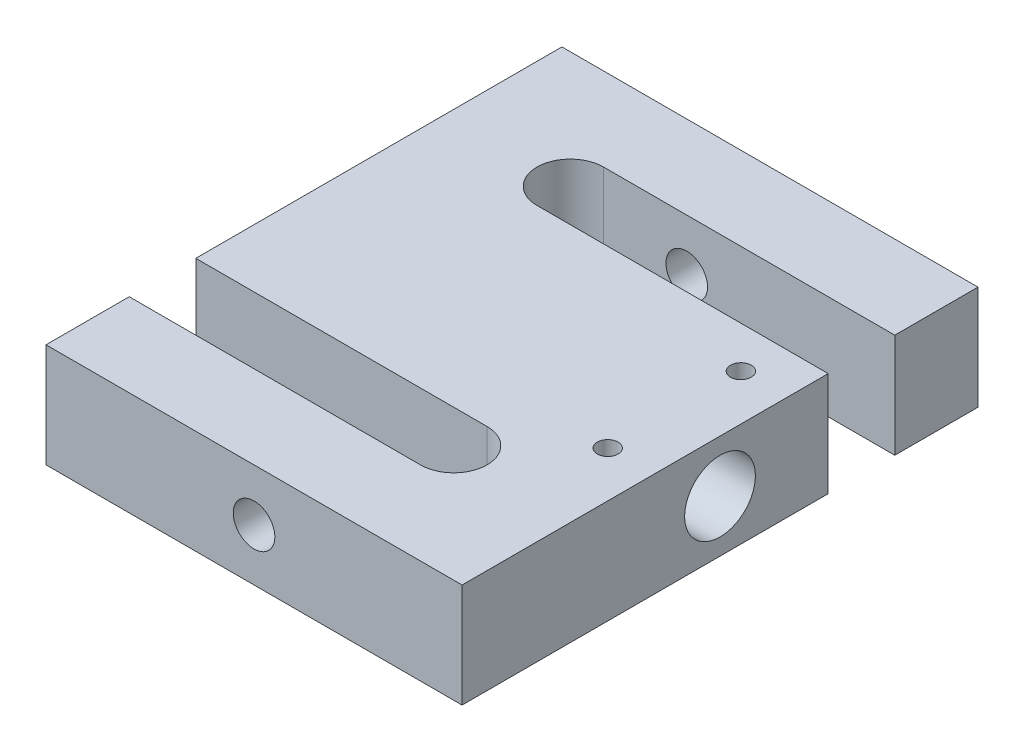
ISO-10303-21;
HEADER;
FILE_DESCRIPTION(('STEP AP214'),'2;1');
FILE_NAME('part.step','',(''),(''),'','','');
FILE_SCHEMA(('AUTOMOTIVE_DESIGN { 1 0 10303 214 1 1 1 1 }'));
ENDSEC;
DATA;
#1=APPLICATION_CONTEXT('core data for automotive mechanical design processes');
#2=APPLICATION_PROTOCOL_DEFINITION('international standard','automotive_design',2000,#1);
#3=PRODUCT_CONTEXT('',#1,'mechanical');
#4=PRODUCT('Part','Part','',(#3));
#5=PRODUCT_RELATED_PRODUCT_CATEGORY('part','',(#4));
#6=PRODUCT_DEFINITION_FORMATION('','',#4);
#7=PRODUCT_DEFINITION_CONTEXT('part definition',#1,'design');
#8=PRODUCT_DEFINITION('design','',#6,#7);
#9=PRODUCT_DEFINITION_SHAPE('','',#8);
#10=(LENGTH_UNIT() NAMED_UNIT(*) SI_UNIT(.MILLI.,.METRE.));
#11=(NAMED_UNIT(*) PLANE_ANGLE_UNIT() SI_UNIT($,.RADIAN.));
#12=(NAMED_UNIT(*) SI_UNIT($,.STERADIAN.) SOLID_ANGLE_UNIT());
#13=UNCERTAINTY_MEASURE_WITH_UNIT(LENGTH_MEASURE(1.E-05),#10,'distance_accuracy_value','');
#14=(GEOMETRIC_REPRESENTATION_CONTEXT(3) GLOBAL_UNCERTAINTY_ASSIGNED_CONTEXT((#13)) GLOBAL_UNIT_ASSIGNED_CONTEXT((#10,
#11,#12)) REPRESENTATION_CONTEXT('',''));
#15=CARTESIAN_POINT('',(0.,0.,0.));
#16=DIRECTION('',(0.,0.,1.));
#17=DIRECTION('',(1.,0.,0.));
#18=AXIS2_PLACEMENT_3D('',#15,#16,#17);
#19=CARTESIAN_POINT('',(0.,12.5,-62.));
#20=DIRECTION('',(0.,0.,1.));
#21=DIRECTION('',(1.,0.,0.));
#22=AXIS2_PLACEMENT_3D('',#19,#20,#21);
#23=PLANE('',#22);
#24=DIRECTION('',(-1.,0.,0.));
#25=VECTOR('',#24,1.);
#26=CARTESIAN_POINT('',(0.,0.,-62.));
#27=LINE('',#26,#25);
#28=CARTESIAN_POINT('',(50.,0.,-62.));
#29=VERTEX_POINT('',#28);
#30=CARTESIAN_POINT('',(0.,0.,-62.));
#31=VERTEX_POINT('',#30);
#32=EDGE_CURVE('E173',#29,#31,#27,.T.);
#33=ORIENTED_EDGE('',*,*,#32,.T.);
#34=DIRECTION('',(0.,-1.,0.));
#35=VECTOR('',#34,1.);
#36=CARTESIAN_POINT('',(0.,12.5,-62.));
#37=LINE('',#36,#35);
#38=CARTESIAN_POINT('',(0.,12.5,-62.));
#39=VERTEX_POINT('',#38);
#40=EDGE_CURVE('E184',#39,#31,#37,.T.);
#41=ORIENTED_EDGE('',*,*,#40,.F.);
#42=DIRECTION('',(-1.,0.,0.));
#43=VECTOR('',#42,1.);
#44=CARTESIAN_POINT('',(0.,12.5,-62.));
#45=LINE('',#44,#43);
#46=CARTESIAN_POINT('',(50.,12.5,-62.));
#47=VERTEX_POINT('',#46);
#48=EDGE_CURVE('E233',#47,#39,#45,.T.);
#49=ORIENTED_EDGE('',*,*,#48,.F.);
#50=DIRECTION('',(0.,-1.,0.));
#51=VECTOR('',#50,1.);
#52=CARTESIAN_POINT('',(50.,12.5,-62.));
#53=LINE('',#52,#51);
#54=EDGE_CURVE('E187',#47,#29,#53,.T.);
#55=ORIENTED_EDGE('',*,*,#54,.T.);
#56=EDGE_LOOP('',(#33,#41,#49,#55));
#57=FACE_BOUND('',#56,.T.);
#58=CARTESIAN_POINT('',(25.,6.25,-62.));
#59=DIRECTION('',(0.,0.,-1.));
#60=DIRECTION('',(-1.,0.,0.));
#61=AXIS2_PLACEMENT_3D('',#58,#59,#60);
#62=CIRCLE('',#61,2.49999999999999);
#63=CARTESIAN_POINT('',(22.5,6.25,-62.));
#64=VERTEX_POINT('',#63);
#65=EDGE_CURVE('E293',#64,#64,#62,.T.);
#66=ORIENTED_EDGE('',*,*,#65,.F.);
#67=EDGE_LOOP('',(#66));
#68=FACE_BOUND('',#67,.T.);
#69=ADVANCED_FACE('F34',(#57,#68),#23,.F.);
#70=CARTESIAN_POINT('',(0.,12.5,0.));
#71=DIRECTION('',(0.,0.,-1.));
#72=DIRECTION('',(-1.,0.,0.));
#73=AXIS2_PLACEMENT_3D('',#70,#71,#72);
#74=PLANE('',#73);
#75=DIRECTION('',(1.,0.,0.));
#76=VECTOR('',#75,1.);
#77=CARTESIAN_POINT('',(0.,0.,0.));
#78=LINE('',#77,#76);
#79=CARTESIAN_POINT('',(0.,0.,0.));
#80=VERTEX_POINT('',#79);
#81=CARTESIAN_POINT('',(50.,0.,0.));
#82=VERTEX_POINT('',#81);
#83=EDGE_CURVE('E160',#80,#82,#78,.T.);
#84=ORIENTED_EDGE('',*,*,#83,.T.);
#85=DIRECTION('',(0.,-1.,0.));
#86=VECTOR('',#85,1.);
#87=CARTESIAN_POINT('',(50.,12.5,0.));
#88=LINE('',#87,#86);
#89=CARTESIAN_POINT('',(50.,12.5,0.));
#90=VERTEX_POINT('',#89);
#91=EDGE_CURVE('E43',#90,#82,#88,.T.);
#92=ORIENTED_EDGE('',*,*,#91,.F.);
#93=DIRECTION('',(1.,0.,0.));
#94=VECTOR('',#93,1.);
#95=CARTESIAN_POINT('',(0.,12.5,0.));
#96=LINE('',#95,#94);
#97=CARTESIAN_POINT('',(0.,12.5,0.));
#98=VERTEX_POINT('',#97);
#99=EDGE_CURVE('E107',#98,#90,#96,.T.);
#100=ORIENTED_EDGE('',*,*,#99,.F.);
#101=DIRECTION('',(0.,-1.,0.));
#102=VECTOR('',#101,1.);
#103=CARTESIAN_POINT('',(0.,12.5,0.));
#104=LINE('',#103,#102);
#105=EDGE_CURVE('E11',#98,#80,#104,.T.);
#106=ORIENTED_EDGE('',*,*,#105,.T.);
#107=EDGE_LOOP('',(#84,#92,#100,#106));
#108=FACE_BOUND('',#107,.T.);
#109=CARTESIAN_POINT('',(25.,6.25,0.));
#110=DIRECTION('',(0.,0.,1.));
#111=DIRECTION('',(1.,0.,0.));
#112=AXIS2_PLACEMENT_3D('',#109,#110,#111);
#113=CIRCLE('',#112,2.5);
#114=CARTESIAN_POINT('',(27.5,6.25,0.));
#115=VERTEX_POINT('',#114);
#116=EDGE_CURVE('E301',#115,#115,#113,.T.);
#117=ORIENTED_EDGE('',*,*,#116,.F.);
#118=EDGE_LOOP('',(#117));
#119=FACE_BOUND('',#118,.T.);
#120=ADVANCED_FACE('F261',(#108,#119),#74,.F.);
#121=CARTESIAN_POINT('',(0.,12.5,0.));
#122=DIRECTION('',(1.,0.,0.));
#123=DIRECTION('',(0.,0.,-1.));
#124=AXIS2_PLACEMENT_3D('',#121,#122,#123);
#125=PLANE('',#124);
#126=DIRECTION('',(0.,0.,1.));
#127=VECTOR('',#126,1.);
#128=CARTESIAN_POINT('',(0.,0.,0.));
#129=LINE('',#128,#127);
#130=CARTESIAN_POINT('',(0.,0.,-9.99999999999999));
#131=VERTEX_POINT('',#130);
#132=EDGE_CURVE('E157',#131,#80,#129,.T.);
#133=ORIENTED_EDGE('',*,*,#132,.T.);
#134=ORIENTED_EDGE('',*,*,#105,.F.);
#135=DIRECTION('',(0.,0.,1.));
#136=VECTOR('',#135,1.);
#137=CARTESIAN_POINT('',(0.,12.5,0.));
#138=LINE('',#137,#136);
#139=CARTESIAN_POINT('',(0.,12.5,-9.99999999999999));
#140=VERTEX_POINT('',#139);
#141=EDGE_CURVE('E180',#140,#98,#138,.T.);
#142=ORIENTED_EDGE('',*,*,#141,.F.);
#143=DIRECTION('',(0.,-1.,0.));
#144=VECTOR('',#143,1.);
#145=CARTESIAN_POINT('',(0.,12.5,-9.99999999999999));
#146=LINE('',#145,#144);
#147=EDGE_CURVE('E153',#140,#131,#146,.T.);
#148=ORIENTED_EDGE('',*,*,#147,.T.);
#149=EDGE_LOOP('',(#133,#134,#142,#148));
#150=FACE_BOUND('',#149,.T.);
#151=ADVANCED_FACE('F36',(#150),#125,.F.);
#152=CARTESIAN_POINT('',(50.,12.5,0.));
#153=DIRECTION('',(-1.,0.,0.));
#154=DIRECTION('',(0.,0.,1.));
#155=AXIS2_PLACEMENT_3D('',#152,#153,#154);
#156=PLANE('',#155);
#157=CARTESIAN_POINT('',(50.,6.25,-31.));
#158=DIRECTION('',(1.,0.,0.));
#159=DIRECTION('',(0.,0.,-1.));
#160=AXIS2_PLACEMENT_3D('',#157,#158,#159);
#161=CIRCLE('',#160,4.25);
#162=CARTESIAN_POINT('',(50.,6.25,-35.25));
#163=VERTEX_POINT('',#162);
#164=EDGE_CURVE('E288',#163,#163,#161,.T.);
#165=ORIENTED_EDGE('',*,*,#164,.F.);
#166=EDGE_LOOP('',(#165));
#167=FACE_BOUND('',#166,.T.);
#168=DIRECTION('',(0.,0.,-1.));
#169=VECTOR('',#168,1.);
#170=CARTESIAN_POINT('',(50.,0.,0.));
#171=LINE('',#170,#169);
#172=CARTESIAN_POINT('',(50.,0.,-44.));
#173=VERTEX_POINT('',#172);
#174=EDGE_CURVE('E163',#82,#173,#171,.T.);
#175=ORIENTED_EDGE('',*,*,#174,.T.);
#176=DIRECTION('',(0.,-1.,0.));
#177=VECTOR('',#176,1.);
#178=CARTESIAN_POINT('',(50.,12.5,-44.));
#179=LINE('',#178,#177);
#180=CARTESIAN_POINT('',(50.,12.5,-44.));
#181=VERTEX_POINT('',#180);
#182=EDGE_CURVE('E199',#181,#173,#179,.T.);
#183=ORIENTED_EDGE('',*,*,#182,.F.);
#184=DIRECTION('',(0.,0.,-1.));
#185=VECTOR('',#184,1.);
#186=CARTESIAN_POINT('',(50.,12.5,0.));
#187=LINE('',#186,#185);
#188=EDGE_CURVE('E207',#90,#181,#187,.T.);
#189=ORIENTED_EDGE('',*,*,#188,.F.);
#190=ORIENTED_EDGE('',*,*,#91,.T.);
#191=EDGE_LOOP('',(#175,#183,#189,#190));
#192=FACE_BOUND('',#191,.T.);
#193=ADVANCED_FACE('F205',(#167,#192),#156,.F.);
#194=CARTESIAN_POINT('',(15.,12.5,-44.));
#195=DIRECTION('',(0.,0.,1.));
#196=DIRECTION('',(1.,0.,0.));
#197=AXIS2_PLACEMENT_3D('',#194,#195,#196);
#198=PLANE('',#197);
#199=DIRECTION('',(-1.,0.,0.));
#200=VECTOR('',#199,1.);
#201=CARTESIAN_POINT('',(15.,0.,-44.));
#202=LINE('',#201,#200);
#203=CARTESIAN_POINT('',(15.,0.,-44.));
#204=VERTEX_POINT('',#203);
#205=EDGE_CURVE('E165',#173,#204,#202,.T.);
#206=ORIENTED_EDGE('',*,*,#205,.T.);
#207=DIRECTION('',(0.,-1.,0.));
#208=VECTOR('',#207,1.);
#209=CARTESIAN_POINT('',(15.,12.5,-44.));
#210=LINE('',#209,#208);
#211=CARTESIAN_POINT('',(15.,12.5,-44.));
#212=VERTEX_POINT('',#211);
#213=EDGE_CURVE('E196',#212,#204,#210,.T.);
#214=ORIENTED_EDGE('',*,*,#213,.F.);
#215=DIRECTION('',(-1.,0.,0.));
#216=VECTOR('',#215,1.);
#217=CARTESIAN_POINT('',(15.,12.5,-44.));
#218=LINE('',#217,#216);
#219=EDGE_CURVE('E225',#181,#212,#218,.T.);
#220=ORIENTED_EDGE('',*,*,#219,.F.);
#221=ORIENTED_EDGE('',*,*,#182,.T.);
#222=EDGE_LOOP('',(#206,#214,#220,#221));
#223=FACE_BOUND('',#222,.T.);
#224=ADVANCED_FACE('F216',(#223),#198,.F.);
#225=CARTESIAN_POINT('',(15.,12.5,-48.));
#226=DIRECTION('',(0.,-1.,0.));
#227=DIRECTION('',(0.,0.,-1.));
#228=AXIS2_PLACEMENT_3D('',#225,#226,#227);
#229=CYLINDRICAL_SURFACE('',#228,4.);
#230=CARTESIAN_POINT('',(15.,0.,-48.));
#231=DIRECTION('',(0.,-1.,0.));
#232=DIRECTION('',(0.,0.,1.));
#233=AXIS2_PLACEMENT_3D('',#230,#231,#232);
#234=CIRCLE('',#233,4.);
#235=CARTESIAN_POINT('',(15.,0.,-52.));
#236=VERTEX_POINT('',#235);
#237=EDGE_CURVE('E167',#204,#236,#234,.T.);
#238=ORIENTED_EDGE('',*,*,#237,.T.);
#239=DIRECTION('',(0.,-1.,0.));
#240=VECTOR('',#239,1.);
#241=CARTESIAN_POINT('',(15.,12.5,-52.));
#242=LINE('',#241,#240);
#243=CARTESIAN_POINT('',(15.,12.5,-52.));
#244=VERTEX_POINT('',#243);
#245=EDGE_CURVE('E193',#244,#236,#242,.T.);
#246=ORIENTED_EDGE('',*,*,#245,.F.);
#247=CARTESIAN_POINT('',(15.,12.5,-48.));
#248=DIRECTION('',(0.,-1.,0.));
#249=DIRECTION('',(0.,0.,1.));
#250=AXIS2_PLACEMENT_3D('',#247,#248,#249);
#251=CIRCLE('',#250,4.);
#252=EDGE_CURVE('E222',#212,#244,#251,.T.);
#253=ORIENTED_EDGE('',*,*,#252,.F.);
#254=ORIENTED_EDGE('',*,*,#213,.T.);
#255=EDGE_LOOP('',(#238,#246,#253,#254));
#256=FACE_BOUND('',#255,.T.);
#257=ADVANCED_FACE('F220',(#256),#229,.F.);
#258=CARTESIAN_POINT('',(15.,12.5,-52.));
#259=DIRECTION('',(0.,0.,-1.));
#260=DIRECTION('',(-1.,0.,0.));
#261=AXIS2_PLACEMENT_3D('',#258,#259,#260);
#262=PLANE('',#261);
#263=CARTESIAN_POINT('',(25.,6.25,-52.));
#264=DIRECTION('',(0.,0.,-1.));
#265=DIRECTION('',(-1.,0.,0.));
#266=AXIS2_PLACEMENT_3D('',#263,#264,#265);
#267=CIRCLE('',#266,2.49999999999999);
#268=CARTESIAN_POINT('',(22.5,6.25,-52.));
#269=VERTEX_POINT('',#268);
#270=EDGE_CURVE('E298',#269,#269,#267,.T.);
#271=ORIENTED_EDGE('',*,*,#270,.T.);
#272=EDGE_LOOP('',(#271));
#273=FACE_BOUND('',#272,.T.);
#274=DIRECTION('',(1.,0.,0.));
#275=VECTOR('',#274,1.);
#276=CARTESIAN_POINT('',(15.,0.,-52.));
#277=LINE('',#276,#275);
#278=CARTESIAN_POINT('',(50.,0.,-52.));
#279=VERTEX_POINT('',#278);
#280=EDGE_CURVE('E169',#236,#279,#277,.T.);
#281=ORIENTED_EDGE('',*,*,#280,.T.);
#282=DIRECTION('',(0.,-1.,0.));
#283=VECTOR('',#282,1.);
#284=CARTESIAN_POINT('',(50.,12.5,-52.));
#285=LINE('',#284,#283);
#286=CARTESIAN_POINT('',(50.,12.5,-52.));
#287=VERTEX_POINT('',#286);
#288=EDGE_CURVE('E190',#287,#279,#285,.T.);
#289=ORIENTED_EDGE('',*,*,#288,.F.);
#290=DIRECTION('',(1.,0.,0.));
#291=VECTOR('',#290,1.);
#292=CARTESIAN_POINT('',(15.,12.5,-52.));
#293=LINE('',#292,#291);
#294=EDGE_CURVE('E224',#244,#287,#293,.T.);
#295=ORIENTED_EDGE('',*,*,#294,.F.);
#296=ORIENTED_EDGE('',*,*,#245,.T.);
#297=EDGE_LOOP('',(#281,#289,#295,#296));
#298=FACE_BOUND('',#297,.T.);
#299=ADVANCED_FACE('F272',(#273,#298),#262,.F.);
#300=CARTESIAN_POINT('',(50.,12.5,-52.));
#301=DIRECTION('',(-1.,0.,0.));
#302=DIRECTION('',(0.,0.,1.));
#303=AXIS2_PLACEMENT_3D('',#300,#301,#302);
#304=PLANE('',#303);
#305=DIRECTION('',(0.,0.,-1.));
#306=VECTOR('',#305,1.);
#307=CARTESIAN_POINT('',(50.,0.,-52.));
#308=LINE('',#307,#306);
#309=EDGE_CURVE('E171',#279,#29,#308,.T.);
#310=ORIENTED_EDGE('',*,*,#309,.T.);
#311=ORIENTED_EDGE('',*,*,#54,.F.);
#312=DIRECTION('',(0.,0.,-1.));
#313=VECTOR('',#312,1.);
#314=CARTESIAN_POINT('',(50.,12.5,-52.));
#315=LINE('',#314,#313);
#316=EDGE_CURVE('E227',#287,#47,#315,.T.);
#317=ORIENTED_EDGE('',*,*,#316,.F.);
#318=ORIENTED_EDGE('',*,*,#288,.T.);
#319=EDGE_LOOP('',(#310,#311,#317,#318));
#320=FACE_BOUND('',#319,.T.);
#321=ADVANCED_FACE('F269',(#320),#304,.F.);
#322=CARTESIAN_POINT('',(0.,12.5,-18.));
#323=DIRECTION('',(1.,0.,0.));
#324=DIRECTION('',(0.,0.,-1.));
#325=AXIS2_PLACEMENT_3D('',#322,#323,#324);
#326=PLANE('',#325);
#327=DIRECTION('',(0.,0.,1.));
#328=VECTOR('',#327,1.);
#329=CARTESIAN_POINT('',(0.,0.,-18.));
#330=LINE('',#329,#328);
#331=CARTESIAN_POINT('',(0.,0.,-18.));
#332=VERTEX_POINT('',#331);
#333=EDGE_CURVE('E175',#31,#332,#330,.T.);
#334=ORIENTED_EDGE('',*,*,#333,.T.);
#335=DIRECTION('',(0.,-1.,0.));
#336=VECTOR('',#335,1.);
#337=CARTESIAN_POINT('',(0.,12.5,-18.));
#338=LINE('',#337,#336);
#339=CARTESIAN_POINT('',(0.,12.5,-18.));
#340=VERTEX_POINT('',#339);
#341=EDGE_CURVE('E148',#340,#332,#338,.T.);
#342=ORIENTED_EDGE('',*,*,#341,.F.);
#343=DIRECTION('',(0.,0.,1.));
#344=VECTOR('',#343,1.);
#345=CARTESIAN_POINT('',(0.,12.5,-18.));
#346=LINE('',#345,#344);
#347=EDGE_CURVE('E139',#39,#340,#346,.T.);
#348=ORIENTED_EDGE('',*,*,#347,.F.);
#349=ORIENTED_EDGE('',*,*,#40,.T.);
#350=EDGE_LOOP('',(#334,#342,#348,#349));
#351=FACE_BOUND('',#350,.T.);
#352=ADVANCED_FACE('F243',(#351),#326,.F.);
#353=CARTESIAN_POINT('',(35.,12.5,-18.));
#354=DIRECTION('',(0.,0.,-1.));
#355=DIRECTION('',(-1.,0.,0.));
#356=AXIS2_PLACEMENT_3D('',#353,#354,#355);
#357=PLANE('',#356);
#358=DIRECTION('',(1.,0.,0.));
#359=VECTOR('',#358,1.);
#360=CARTESIAN_POINT('',(35.,0.,-18.));
#361=LINE('',#360,#359);
#362=CARTESIAN_POINT('',(35.,0.,-18.));
#363=VERTEX_POINT('',#362);
#364=EDGE_CURVE('E147',#332,#363,#361,.T.);
#365=ORIENTED_EDGE('',*,*,#364,.T.);
#366=DIRECTION('',(0.,-1.,0.));
#367=VECTOR('',#366,1.);
#368=CARTESIAN_POINT('',(35.,12.5,-18.));
#369=LINE('',#368,#367);
#370=CARTESIAN_POINT('',(35.,12.5,-18.));
#371=VERTEX_POINT('',#370);
#372=EDGE_CURVE('E144',#371,#363,#369,.T.);
#373=ORIENTED_EDGE('',*,*,#372,.F.);
#374=DIRECTION('',(1.,0.,0.));
#375=VECTOR('',#374,1.);
#376=CARTESIAN_POINT('',(35.,12.5,-18.));
#377=LINE('',#376,#375);
#378=EDGE_CURVE('E133',#340,#371,#377,.T.);
#379=ORIENTED_EDGE('',*,*,#378,.F.);
#380=ORIENTED_EDGE('',*,*,#341,.T.);
#381=EDGE_LOOP('',(#365,#373,#379,#380));
#382=FACE_BOUND('',#381,.T.);
#383=ADVANCED_FACE('F145',(#382),#357,.F.);
#384=CARTESIAN_POINT('',(35.,12.5,-14.));
#385=DIRECTION('',(0.,-1.,0.));
#386=DIRECTION('',(0.,0.,-1.));
#387=AXIS2_PLACEMENT_3D('',#384,#385,#386);
#388=CYLINDRICAL_SURFACE('',#387,4.00000000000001);
#389=CARTESIAN_POINT('',(35.,0.,-14.));
#390=DIRECTION('',(0.,-1.,0.));
#391=DIRECTION('',(0.,0.,1.));
#392=AXIS2_PLACEMENT_3D('',#389,#390,#391);
#393=CIRCLE('',#392,4.00000000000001);
#394=CARTESIAN_POINT('',(35.,0.,-9.99999999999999));
#395=VERTEX_POINT('',#394);
#396=EDGE_CURVE('E93',#363,#395,#393,.T.);
#397=ORIENTED_EDGE('',*,*,#396,.T.);
#398=DIRECTION('',(0.,-1.,0.));
#399=VECTOR('',#398,1.);
#400=CARTESIAN_POINT('',(35.,12.5,-9.99999999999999));
#401=LINE('',#400,#399);
#402=CARTESIAN_POINT('',(35.,12.5,-9.99999999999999));
#403=VERTEX_POINT('',#402);
#404=EDGE_CURVE('E149',#403,#395,#401,.T.);
#405=ORIENTED_EDGE('',*,*,#404,.F.);
#406=CARTESIAN_POINT('',(35.,12.5,-14.));
#407=DIRECTION('',(0.,-1.,0.));
#408=DIRECTION('',(0.,0.,1.));
#409=AXIS2_PLACEMENT_3D('',#406,#407,#408);
#410=CIRCLE('',#409,4.00000000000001);
#411=EDGE_CURVE('E137',#371,#403,#410,.T.);
#412=ORIENTED_EDGE('',*,*,#411,.F.);
#413=ORIENTED_EDGE('',*,*,#372,.T.);
#414=EDGE_LOOP('',(#397,#405,#412,#413));
#415=FACE_BOUND('',#414,.T.);
#416=ADVANCED_FACE('F151',(#415),#388,.F.);
#417=CARTESIAN_POINT('',(35.,12.5,-9.99999999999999));
#418=DIRECTION('',(0.,0.,1.));
#419=DIRECTION('',(1.,0.,0.));
#420=AXIS2_PLACEMENT_3D('',#417,#418,#419);
#421=PLANE('',#420);
#422=CARTESIAN_POINT('',(25.,6.25,-9.99999999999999));
#423=DIRECTION('',(0.,0.,1.));
#424=DIRECTION('',(1.,0.,0.));
#425=AXIS2_PLACEMENT_3D('',#422,#423,#424);
#426=CIRCLE('',#425,2.5);
#427=CARTESIAN_POINT('',(27.5,6.25,-9.99999999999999));
#428=VERTEX_POINT('',#427);
#429=EDGE_CURVE('E304',#428,#428,#426,.T.);
#430=ORIENTED_EDGE('',*,*,#429,.T.);
#431=EDGE_LOOP('',(#430));
#432=FACE_BOUND('',#431,.T.);
#433=DIRECTION('',(-1.,0.,0.));
#434=VECTOR('',#433,1.);
#435=CARTESIAN_POINT('',(35.,0.,-9.99999999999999));
#436=LINE('',#435,#434);
#437=EDGE_CURVE('E99',#395,#131,#436,.T.);
#438=ORIENTED_EDGE('',*,*,#437,.T.);
#439=ORIENTED_EDGE('',*,*,#147,.F.);
#440=DIRECTION('',(-1.,0.,0.));
#441=VECTOR('',#440,1.);
#442=CARTESIAN_POINT('',(35.,12.5,-9.99999999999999));
#443=LINE('',#442,#441);
#444=EDGE_CURVE('E51',#403,#140,#443,.T.);
#445=ORIENTED_EDGE('',*,*,#444,.F.);
#446=ORIENTED_EDGE('',*,*,#404,.T.);
#447=EDGE_LOOP('',(#438,#439,#445,#446));
#448=FACE_BOUND('',#447,.T.);
#449=ADVANCED_FACE('F247',(#432,#448),#421,.F.);
#450=CARTESIAN_POINT('',(35.,12.5,-14.));
#451=DIRECTION('',(0.,1.,0.));
#452=DIRECTION('',(0.,0.,1.));
#453=AXIS2_PLACEMENT_3D('',#450,#451,#452);
#454=PLANE('',#453);
#455=CARTESIAN_POINT('',(44.5,12.5,-39.));
#456=DIRECTION('',(0.,1.,0.));
#457=DIRECTION('',(0.,0.,1.));
#458=AXIS2_PLACEMENT_3D('',#455,#456,#457);
#459=CIRCLE('',#458,1.24999999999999);
#460=CARTESIAN_POINT('',(44.5,12.5,-37.75));
#461=VERTEX_POINT('',#460);
#462=EDGE_CURVE('E306',#461,#461,#459,.T.);
#463=ORIENTED_EDGE('',*,*,#462,.F.);
#464=EDGE_LOOP('',(#463));
#465=FACE_BOUND('',#464,.T.);
#466=CARTESIAN_POINT('',(44.5,12.5,-23.));
#467=DIRECTION('',(0.,1.,0.));
#468=DIRECTION('',(0.,0.,1.));
#469=AXIS2_PLACEMENT_3D('',#466,#467,#468);
#470=CIRCLE('',#469,1.24999999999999);
#471=CARTESIAN_POINT('',(44.5,12.5,-21.75));
#472=VERTEX_POINT('',#471);
#473=EDGE_CURVE('E312',#472,#472,#470,.T.);
#474=ORIENTED_EDGE('',*,*,#473,.F.);
#475=EDGE_LOOP('',(#474));
#476=FACE_BOUND('',#475,.T.);
#477=ORIENTED_EDGE('',*,*,#141,.T.);
#478=ORIENTED_EDGE('',*,*,#99,.T.);
#479=ORIENTED_EDGE('',*,*,#188,.T.);
#480=ORIENTED_EDGE('',*,*,#219,.T.);
#481=ORIENTED_EDGE('',*,*,#252,.T.);
#482=ORIENTED_EDGE('',*,*,#294,.T.);
#483=ORIENTED_EDGE('',*,*,#316,.T.);
#484=ORIENTED_EDGE('',*,*,#48,.T.);
#485=ORIENTED_EDGE('',*,*,#347,.T.);
#486=ORIENTED_EDGE('',*,*,#378,.T.);
#487=ORIENTED_EDGE('',*,*,#411,.T.);
#488=ORIENTED_EDGE('',*,*,#444,.T.);
#489=EDGE_LOOP('',(#477,#478,#479,#480,#481,#482,#483,#484,#485,#486,#487,#488));
#490=FACE_BOUND('',#489,.T.);
#491=ADVANCED_FACE('F135',(#465,#476,#490),#454,.T.);
#492=CARTESIAN_POINT('',(35.,0.,-14.));
#493=DIRECTION('',(0.,1.,0.));
#494=DIRECTION('',(0.,0.,1.));
#495=AXIS2_PLACEMENT_3D('',#492,#493,#494);
#496=PLANE('',#495);
#497=CARTESIAN_POINT('',(44.5,0.,-39.));
#498=DIRECTION('',(0.,1.,0.));
#499=DIRECTION('',(0.,0.,1.));
#500=AXIS2_PLACEMENT_3D('',#497,#498,#499);
#501=CIRCLE('',#500,1.25);
#502=CARTESIAN_POINT('',(44.5,0.,-37.75));
#503=VERTEX_POINT('',#502);
#504=EDGE_CURVE('E309',#503,#503,#501,.T.);
#505=ORIENTED_EDGE('',*,*,#504,.T.);
#506=EDGE_LOOP('',(#505));
#507=FACE_BOUND('',#506,.T.);
#508=CARTESIAN_POINT('',(44.5,0.,-23.));
#509=DIRECTION('',(0.,1.,0.));
#510=DIRECTION('',(0.,0.,1.));
#511=AXIS2_PLACEMENT_3D('',#508,#509,#510);
#512=CIRCLE('',#511,1.25);
#513=CARTESIAN_POINT('',(44.5,0.,-21.75));
#514=VERTEX_POINT('',#513);
#515=EDGE_CURVE('E161',#514,#514,#512,.T.);
#516=ORIENTED_EDGE('',*,*,#515,.T.);
#517=EDGE_LOOP('',(#516));
#518=FACE_BOUND('',#517,.T.);
#519=ORIENTED_EDGE('',*,*,#132,.F.);
#520=ORIENTED_EDGE('',*,*,#437,.F.);
#521=ORIENTED_EDGE('',*,*,#396,.F.);
#522=ORIENTED_EDGE('',*,*,#364,.F.);
#523=ORIENTED_EDGE('',*,*,#333,.F.);
#524=ORIENTED_EDGE('',*,*,#32,.F.);
#525=ORIENTED_EDGE('',*,*,#309,.F.);
#526=ORIENTED_EDGE('',*,*,#280,.F.);
#527=ORIENTED_EDGE('',*,*,#237,.F.);
#528=ORIENTED_EDGE('',*,*,#205,.F.);
#529=ORIENTED_EDGE('',*,*,#174,.F.);
#530=ORIENTED_EDGE('',*,*,#83,.F.);
#531=EDGE_LOOP('',(#519,#520,#521,#522,#523,#524,#525,#526,#527,#528,#529,#530));
#532=FACE_BOUND('',#531,.T.);
#533=ADVANCED_FACE('F211',(#507,#518,#532),#496,.F.);
#534=CARTESIAN_POINT('',(44.5,12.5,-23.));
#535=DIRECTION('',(0.,1.,0.));
#536=DIRECTION('',(0.,0.,1.));
#537=AXIS2_PLACEMENT_3D('',#534,#535,#536);
#538=CYLINDRICAL_SURFACE('',#537,1.24999999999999);
#539=ORIENTED_EDGE('',*,*,#515,.F.);
#540=EDGE_LOOP('',(#539));
#541=FACE_BOUND('',#540,.T.);
#542=ORIENTED_EDGE('',*,*,#473,.T.);
#543=EDGE_LOOP('',(#542));
#544=FACE_BOUND('',#543,.T.);
#545=ADVANCED_FACE('F321',(#541,#544),#538,.F.);
#546=CARTESIAN_POINT('',(44.5,12.5,-39.));
#547=DIRECTION('',(0.,1.,0.));
#548=DIRECTION('',(0.,0.,1.));
#549=AXIS2_PLACEMENT_3D('',#546,#547,#548);
#550=CYLINDRICAL_SURFACE('',#549,1.24999999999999);
#551=ORIENTED_EDGE('',*,*,#504,.F.);
#552=EDGE_LOOP('',(#551));
#553=FACE_BOUND('',#552,.T.);
#554=ORIENTED_EDGE('',*,*,#462,.T.);
#555=EDGE_LOOP('',(#554));
#556=FACE_BOUND('',#555,.T.);
#557=ADVANCED_FACE('F324',(#553,#556),#550,.F.);
#558=CARTESIAN_POINT('',(25.,6.25,0.));
#559=DIRECTION('',(0.,0.,1.));
#560=DIRECTION('',(1.,0.,0.));
#561=AXIS2_PLACEMENT_3D('',#558,#559,#560);
#562=CYLINDRICAL_SURFACE('',#561,2.5);
#563=ORIENTED_EDGE('',*,*,#429,.F.);
#564=EDGE_LOOP('',(#563));
#565=FACE_BOUND('',#564,.T.);
#566=ORIENTED_EDGE('',*,*,#116,.T.);
#567=EDGE_LOOP('',(#566));
#568=FACE_BOUND('',#567,.T.);
#569=ADVANCED_FACE('F332',(#565,#568),#562,.F.);
#570=CARTESIAN_POINT('',(25.,6.25,-62.));
#571=DIRECTION('',(0.,0.,-1.));
#572=DIRECTION('',(-1.,0.,0.));
#573=AXIS2_PLACEMENT_3D('',#570,#571,#572);
#574=CYLINDRICAL_SURFACE('',#573,2.49999999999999);
#575=ORIENTED_EDGE('',*,*,#270,.F.);
#576=EDGE_LOOP('',(#575));
#577=FACE_BOUND('',#576,.T.);
#578=ORIENTED_EDGE('',*,*,#65,.T.);
#579=EDGE_LOOP('',(#578));
#580=FACE_BOUND('',#579,.T.);
#581=ADVANCED_FACE('F339',(#577,#580),#574,.F.);
#582=CARTESIAN_POINT('',(40.,6.25,-31.));
#583=DIRECTION('',(1.,0.,0.));
#584=DIRECTION('',(0.,0.,-1.));
#585=AXIS2_PLACEMENT_3D('',#582,#583,#584);
#586=CONICAL_SURFACE('',#585,4.25,1.02974425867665);
#587=CARTESIAN_POINT('',(37.4463423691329,6.25,-31.));
#588=VERTEX_POINT('',#587);
#589=VERTEX_LOOP('',#588);
#590=FACE_BOUND('',#589,.T.);
#591=CARTESIAN_POINT('',(40.,6.25,-31.));
#592=DIRECTION('',(1.,0.,0.));
#593=DIRECTION('',(0.,0.,-1.));
#594=AXIS2_PLACEMENT_3D('',#591,#592,#593);
#595=CIRCLE('',#594,4.25);
#596=CARTESIAN_POINT('',(40.,6.25,-35.25));
#597=VERTEX_POINT('',#596);
#598=EDGE_CURVE('E290',#597,#597,#595,.T.);
#599=ORIENTED_EDGE('',*,*,#598,.T.);
#600=EDGE_LOOP('',(#599));
#601=FACE_BOUND('',#600,.T.);
#602=ADVANCED_FACE('F343',(#590,#601),#586,.F.);
#603=CARTESIAN_POINT('',(50.,6.25,-31.));
#604=DIRECTION('',(1.,0.,0.));
#605=DIRECTION('',(0.,0.,-1.));
#606=AXIS2_PLACEMENT_3D('',#603,#604,#605);
#607=CYLINDRICAL_SURFACE('',#606,4.25);
#608=ORIENTED_EDGE('',*,*,#598,.F.);
#609=EDGE_LOOP('',(#608));
#610=FACE_BOUND('',#609,.T.);
#611=ORIENTED_EDGE('',*,*,#164,.T.);
#612=EDGE_LOOP('',(#611));
#613=FACE_BOUND('',#612,.T.);
#614=ADVANCED_FACE('F347',(#610,#613),#607,.F.);
#615=CLOSED_SHELL('',(#69,#120,#151,#193,#224,#257,#299,#321,#352,#383,#416,#449,#491,#533,#545,
#557,#569,#581,#602,#614));
#616=MANIFOLD_SOLID_BREP('B2',#615);
#617=ADVANCED_BREP_SHAPE_REPRESENTATION('',(#18,#616),#14);
#618=SHAPE_DEFINITION_REPRESENTATION(#9,#617);
ENDSEC;
END-ISO-10303-21;
